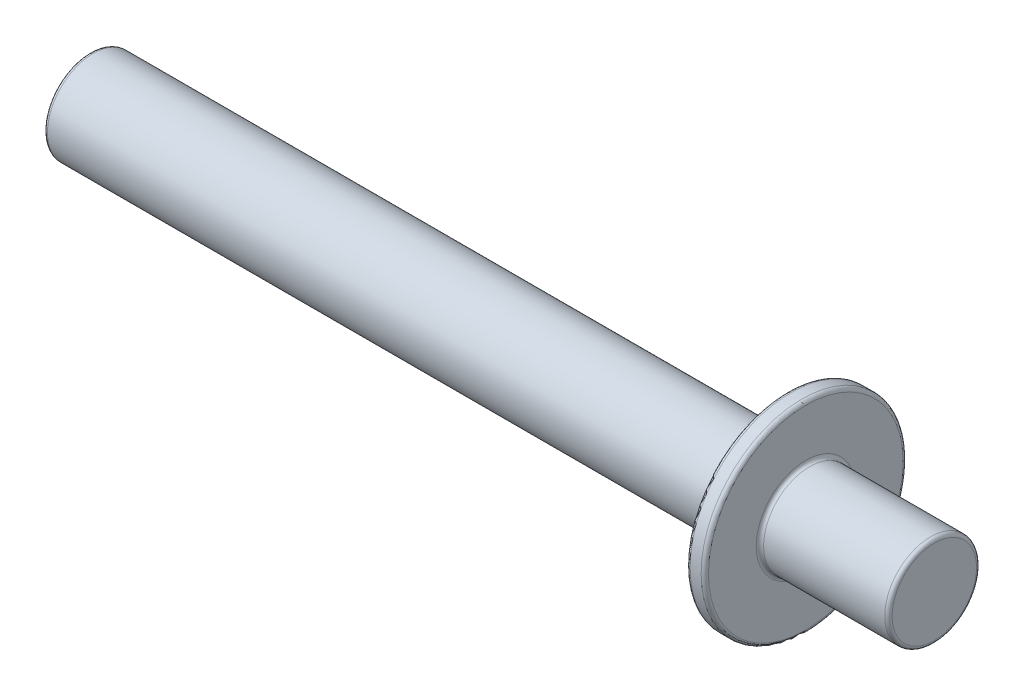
ISO-10303-21;
HEADER;
FILE_DESCRIPTION(('STEP AP214'),'2;1');
FILE_NAME('part.step','',(''),(''),'','','');
FILE_SCHEMA(('AUTOMOTIVE_DESIGN { 1 0 10303 214 1 1 1 1 }'));
ENDSEC;
DATA;
#1=APPLICATION_CONTEXT('core data for automotive mechanical design processes');
#2=APPLICATION_PROTOCOL_DEFINITION('international standard','automotive_design',2000,#1);
#3=PRODUCT_CONTEXT('',#1,'mechanical');
#4=PRODUCT('Part','Part','',(#3));
#5=PRODUCT_RELATED_PRODUCT_CATEGORY('part','',(#4));
#6=PRODUCT_DEFINITION_FORMATION('','',#4);
#7=PRODUCT_DEFINITION_CONTEXT('part definition',#1,'design');
#8=PRODUCT_DEFINITION('design','',#6,#7);
#9=PRODUCT_DEFINITION_SHAPE('','',#8);
#10=(LENGTH_UNIT() NAMED_UNIT(*) SI_UNIT(.MILLI.,.METRE.));
#11=(NAMED_UNIT(*) PLANE_ANGLE_UNIT() SI_UNIT($,.RADIAN.));
#12=(NAMED_UNIT(*) SI_UNIT($,.STERADIAN.) SOLID_ANGLE_UNIT());
#13=UNCERTAINTY_MEASURE_WITH_UNIT(LENGTH_MEASURE(1.E-05),#10,'distance_accuracy_value','');
#14=(GEOMETRIC_REPRESENTATION_CONTEXT(3) GLOBAL_UNCERTAINTY_ASSIGNED_CONTEXT((#13)) GLOBAL_UNIT_ASSIGNED_CONTEXT((#10,
#11,#12)) REPRESENTATION_CONTEXT('',''));
#15=CARTESIAN_POINT('',(0.,0.,0.));
#16=DIRECTION('',(0.,0.,1.));
#17=DIRECTION('',(1.,0.,0.));
#18=AXIS2_PLACEMENT_3D('',#15,#16,#17);
#19=CARTESIAN_POINT('',(-46.,0.,0.));
#20=DIRECTION('',(1.,0.,0.));
#21=DIRECTION('',(0.,0.,-1.));
#22=AXIS2_PLACEMENT_3D('',#19,#20,#21);
#23=PLANE('',#22);
#24=CARTESIAN_POINT('',(-46.,0.,0.));
#25=DIRECTION('',(1.,0.,0.));
#26=DIRECTION('',(0.,0.,-1.));
#27=AXIS2_PLACEMENT_3D('',#24,#25,#26);
#28=CIRCLE('',#27,2.3);
#29=CARTESIAN_POINT('',(-46.,0.,-2.3));
#30=VERTEX_POINT('',#29);
#31=EDGE_CURVE('E10',#30,#30,#28,.F.);
#32=ORIENTED_EDGE('',*,*,#31,.T.);
#33=EDGE_LOOP('',(#32));
#34=FACE_BOUND('',#33,.T.);
#35=ADVANCED_FACE('F29',(#34),#23,.F.);
#36=CARTESIAN_POINT('',(-86.0867088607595,0.,0.));
#37=DIRECTION('',(-1.,0.,0.));
#38=DIRECTION('',(0.,0.,1.));
#39=AXIS2_PLACEMENT_3D('',#36,#37,#38);
#40=CYLINDRICAL_SURFACE('',#39,2.5);
#41=CARTESIAN_POINT('',(-8.20000000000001,0.,0.));
#42=DIRECTION('',(1.,0.,0.));
#43=DIRECTION('',(0.,0.,-1.));
#44=AXIS2_PLACEMENT_3D('',#41,#42,#43);
#45=CIRCLE('',#44,2.5);
#46=CARTESIAN_POINT('',(-8.20000000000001,0.,-2.5));
#47=VERTEX_POINT('',#46);
#48=EDGE_CURVE('E35',#47,#47,#45,.F.);
#49=ORIENTED_EDGE('',*,*,#48,.T.);
#50=EDGE_LOOP('',(#49));
#51=FACE_BOUND('',#50,.T.);
#52=CARTESIAN_POINT('',(-45.8,0.,0.));
#53=DIRECTION('',(1.,0.,0.));
#54=DIRECTION('',(0.,0.,-1.));
#55=AXIS2_PLACEMENT_3D('',#52,#53,#54);
#56=CIRCLE('',#55,2.5);
#57=CARTESIAN_POINT('',(-45.8,0.,-2.5));
#58=VERTEX_POINT('',#57);
#59=EDGE_CURVE('E39',#58,#58,#56,.T.);
#60=ORIENTED_EDGE('',*,*,#59,.T.);
#61=EDGE_LOOP('',(#60));
#62=FACE_BOUND('',#61,.T.);
#63=ADVANCED_FACE('F86',(#51,#62),#40,.T.);
#64=CARTESIAN_POINT('',(-8.00000000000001,2.5,0.));
#65=DIRECTION('',(1.,0.,0.));
#66=DIRECTION('',(0.,0.,-1.));
#67=AXIS2_PLACEMENT_3D('',#64,#65,#66);
#68=PLANE('',#67);
#69=CARTESIAN_POINT('',(-8.00000000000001,0.,0.));
#70=DIRECTION('',(1.,0.,0.));
#71=DIRECTION('',(0.,0.,-1.));
#72=AXIS2_PLACEMENT_3D('',#69,#70,#71);
#73=CIRCLE('',#72,5.3);
#74=CARTESIAN_POINT('',(-8.00000000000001,0.,-5.3));
#75=VERTEX_POINT('',#74);
#76=EDGE_CURVE('E54',#75,#75,#73,.F.);
#77=ORIENTED_EDGE('',*,*,#76,.T.);
#78=EDGE_LOOP('',(#77));
#79=FACE_BOUND('',#78,.T.);
#80=CARTESIAN_POINT('',(-8.00000000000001,0.,0.));
#81=DIRECTION('',(1.,0.,0.));
#82=DIRECTION('',(0.,0.,-1.));
#83=AXIS2_PLACEMENT_3D('',#80,#81,#82);
#84=CIRCLE('',#83,2.7);
#85=CARTESIAN_POINT('',(-8.00000000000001,0.,-2.7));
#86=VERTEX_POINT('',#85);
#87=EDGE_CURVE('E57',#86,#86,#84,.T.);
#88=ORIENTED_EDGE('',*,*,#87,.T.);
#89=EDGE_LOOP('',(#88));
#90=FACE_BOUND('',#89,.T.);
#91=ADVANCED_FACE('F83',(#79,#90),#68,.F.);
#92=CARTESIAN_POINT('',(-86.0867088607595,0.,0.));
#93=DIRECTION('',(-1.,0.,0.));
#94=DIRECTION('',(0.,0.,1.));
#95=AXIS2_PLACEMENT_3D('',#92,#93,#94);
#96=CYLINDRICAL_SURFACE('',#95,5.5);
#97=CARTESIAN_POINT('',(-7.2,0.,0.));
#98=DIRECTION('',(-1.,0.,0.));
#99=DIRECTION('',(0.,0.,1.));
#100=AXIS2_PLACEMENT_3D('',#97,#98,#99);
#101=CIRCLE('',#100,5.5);
#102=CARTESIAN_POINT('',(-7.2,0.,5.5));
#103=VERTEX_POINT('',#102);
#104=EDGE_CURVE('E66',#103,#103,#101,.T.);
#105=ORIENTED_EDGE('',*,*,#104,.T.);
#106=EDGE_LOOP('',(#105));
#107=FACE_BOUND('',#106,.T.);
#108=CARTESIAN_POINT('',(-7.8,0.,0.));
#109=DIRECTION('',(1.,0.,0.));
#110=DIRECTION('',(0.,0.,-1.));
#111=AXIS2_PLACEMENT_3D('',#108,#109,#110);
#112=CIRCLE('',#111,5.5);
#113=CARTESIAN_POINT('',(-7.8,0.,-5.5));
#114=VERTEX_POINT('',#113);
#115=EDGE_CURVE('E69',#114,#114,#112,.T.);
#116=ORIENTED_EDGE('',*,*,#115,.T.);
#117=EDGE_LOOP('',(#116));
#118=FACE_BOUND('',#117,.T.);
#119=ADVANCED_FACE('F73',(#107,#118),#96,.T.);
#120=CARTESIAN_POINT('',(-7.,5.5,0.));
#121=DIRECTION('',(-1.,0.,0.));
#122=DIRECTION('',(0.,0.,1.));
#123=AXIS2_PLACEMENT_3D('',#120,#121,#122);
#124=PLANE('',#123);
#125=CARTESIAN_POINT('',(-7.,0.,0.));
#126=DIRECTION('',(-1.,0.,0.));
#127=DIRECTION('',(0.,0.,1.));
#128=AXIS2_PLACEMENT_3D('',#125,#126,#127);
#129=CIRCLE('',#128,5.3);
#130=CARTESIAN_POINT('',(-7.,0.,5.3));
#131=VERTEX_POINT('',#130);
#132=EDGE_CURVE('E60',#131,#131,#129,.F.);
#133=ORIENTED_EDGE('',*,*,#132,.T.);
#134=EDGE_LOOP('',(#133));
#135=FACE_BOUND('',#134,.T.);
#136=CARTESIAN_POINT('',(-7.,0.,0.));
#137=DIRECTION('',(-1.,0.,0.));
#138=DIRECTION('',(0.,0.,1.));
#139=AXIS2_PLACEMENT_3D('',#136,#137,#138);
#140=CIRCLE('',#139,2.7);
#141=CARTESIAN_POINT('',(-7.,0.,2.7));
#142=VERTEX_POINT('',#141);
#143=EDGE_CURVE('E63',#142,#142,#140,.T.);
#144=ORIENTED_EDGE('',*,*,#143,.T.);
#145=EDGE_LOOP('',(#144));
#146=FACE_BOUND('',#145,.T.);
#147=ADVANCED_FACE('F114',(#135,#146),#124,.F.);
#148=CARTESIAN_POINT('',(-86.0867088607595,0.,0.));
#149=DIRECTION('',(-1.,0.,0.));
#150=DIRECTION('',(0.,0.,1.));
#151=AXIS2_PLACEMENT_3D('',#148,#149,#150);
#152=CYLINDRICAL_SURFACE('',#151,2.5);
#153=CARTESIAN_POINT('',(-0.200000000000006,0.,0.));
#154=DIRECTION('',(-1.,0.,0.));
#155=DIRECTION('',(0.,0.,1.));
#156=AXIS2_PLACEMENT_3D('',#153,#154,#155);
#157=CIRCLE('',#156,2.5);
#158=CARTESIAN_POINT('',(-0.200000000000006,0.,2.5));
#159=VERTEX_POINT('',#158);
#160=EDGE_CURVE('E48',#159,#159,#157,.T.);
#161=ORIENTED_EDGE('',*,*,#160,.T.);
#162=EDGE_LOOP('',(#161));
#163=FACE_BOUND('',#162,.T.);
#164=CARTESIAN_POINT('',(-6.8,0.,0.));
#165=DIRECTION('',(-1.,0.,0.));
#166=DIRECTION('',(0.,0.,1.));
#167=AXIS2_PLACEMENT_3D('',#164,#165,#166);
#168=CIRCLE('',#167,2.5);
#169=CARTESIAN_POINT('',(-6.8,0.,2.5));
#170=VERTEX_POINT('',#169);
#171=EDGE_CURVE('E51',#170,#170,#168,.F.);
#172=ORIENTED_EDGE('',*,*,#171,.T.);
#173=EDGE_LOOP('',(#172));
#174=FACE_BOUND('',#173,.T.);
#175=ADVANCED_FACE('F118',(#163,#174),#152,.T.);
#176=CARTESIAN_POINT('',(0.,2.5,0.));
#177=DIRECTION('',(-1.,0.,0.));
#178=DIRECTION('',(0.,0.,1.));
#179=AXIS2_PLACEMENT_3D('',#176,#177,#178);
#180=PLANE('',#179);
#181=CARTESIAN_POINT('',(0.,0.,0.));
#182=DIRECTION('',(-1.,0.,0.));
#183=DIRECTION('',(0.,0.,1.));
#184=AXIS2_PLACEMENT_3D('',#181,#182,#183);
#185=CIRCLE('',#184,2.3);
#186=CARTESIAN_POINT('',(0.,0.,2.3));
#187=VERTEX_POINT('',#186);
#188=EDGE_CURVE('E43',#187,#187,#185,.F.);
#189=ORIENTED_EDGE('',*,*,#188,.T.);
#190=EDGE_LOOP('',(#189));
#191=FACE_BOUND('',#190,.T.);
#192=ADVANCED_FACE('F122',(#191),#180,.F.);
#193=CARTESIAN_POINT('',(-7.2,0.,0.));
#194=DIRECTION('',(-1.,0.,0.));
#195=DIRECTION('',(0.,0.,1.));
#196=AXIS2_PLACEMENT_3D('',#193,#194,#195);
#197=TOROIDAL_SURFACE('',#196,5.3,0.2);
#198=ORIENTED_EDGE('',*,*,#132,.F.);
#199=EDGE_LOOP('',(#198));
#200=FACE_BOUND('',#199,.T.);
#201=ORIENTED_EDGE('',*,*,#104,.F.);
#202=EDGE_LOOP('',(#201));
#203=FACE_BOUND('',#202,.T.);
#204=ADVANCED_FACE('F79',(#200,#203),#197,.T.);
#205=CARTESIAN_POINT('',(-7.8,0.,0.));
#206=DIRECTION('',(1.,0.,0.));
#207=DIRECTION('',(0.,0.,-1.));
#208=AXIS2_PLACEMENT_3D('',#205,#206,#207);
#209=TOROIDAL_SURFACE('',#208,5.3,0.2);
#210=ORIENTED_EDGE('',*,*,#115,.F.);
#211=EDGE_LOOP('',(#210));
#212=FACE_BOUND('',#211,.T.);
#213=ORIENTED_EDGE('',*,*,#76,.F.);
#214=EDGE_LOOP('',(#213));
#215=FACE_BOUND('',#214,.T.);
#216=ADVANCED_FACE('F75',(#212,#215),#209,.T.);
#217=CARTESIAN_POINT('',(-0.200000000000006,0.,0.));
#218=DIRECTION('',(-1.,0.,0.));
#219=DIRECTION('',(0.,0.,1.));
#220=AXIS2_PLACEMENT_3D('',#217,#218,#219);
#221=TOROIDAL_SURFACE('',#220,2.3,0.2);
#222=ORIENTED_EDGE('',*,*,#188,.F.);
#223=EDGE_LOOP('',(#222));
#224=FACE_BOUND('',#223,.T.);
#225=ORIENTED_EDGE('',*,*,#160,.F.);
#226=EDGE_LOOP('',(#225));
#227=FACE_BOUND('',#226,.T.);
#228=ADVANCED_FACE('F78',(#224,#227),#221,.T.);
#229=CARTESIAN_POINT('',(-6.8,0.,0.));
#230=DIRECTION('',(-1.,0.,0.));
#231=DIRECTION('',(0.,0.,1.));
#232=AXIS2_PLACEMENT_3D('',#229,#230,#231);
#233=TOROIDAL_SURFACE('',#232,2.7,0.2);
#234=ORIENTED_EDGE('',*,*,#171,.F.);
#235=EDGE_LOOP('',(#234));
#236=FACE_BOUND('',#235,.T.);
#237=ORIENTED_EDGE('',*,*,#143,.F.);
#238=EDGE_LOOP('',(#237));
#239=FACE_BOUND('',#238,.T.);
#240=ADVANCED_FACE('F94',(#236,#239),#233,.F.);
#241=CARTESIAN_POINT('',(-8.20000000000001,0.,0.));
#242=DIRECTION('',(1.,0.,0.));
#243=DIRECTION('',(0.,0.,-1.));
#244=AXIS2_PLACEMENT_3D('',#241,#242,#243);
#245=TOROIDAL_SURFACE('',#244,2.7,0.2);
#246=ORIENTED_EDGE('',*,*,#87,.F.);
#247=EDGE_LOOP('',(#246));
#248=FACE_BOUND('',#247,.T.);
#249=ORIENTED_EDGE('',*,*,#48,.F.);
#250=EDGE_LOOP('',(#249));
#251=FACE_BOUND('',#250,.T.);
#252=ADVANCED_FACE('F90',(#248,#251),#245,.F.);
#253=CARTESIAN_POINT('',(-45.8,0.,0.));
#254=DIRECTION('',(1.,0.,0.));
#255=DIRECTION('',(0.,0.,-1.));
#256=AXIS2_PLACEMENT_3D('',#253,#254,#255);
#257=TOROIDAL_SURFACE('',#256,2.3,0.2);
#258=ORIENTED_EDGE('',*,*,#59,.F.);
#259=EDGE_LOOP('',(#258));
#260=FACE_BOUND('',#259,.T.);
#261=ORIENTED_EDGE('',*,*,#31,.F.);
#262=EDGE_LOOP('',(#261));
#263=FACE_BOUND('',#262,.T.);
#264=ADVANCED_FACE('F93',(#260,#263),#257,.T.);
#265=CLOSED_SHELL('',(#35,#63,#91,#119,#147,#175,#192,#204,#216,#228,#240,#252,#264));
#266=MANIFOLD_SOLID_BREP('B2',#265);
#267=ADVANCED_BREP_SHAPE_REPRESENTATION('',(#18,#266),#14);
#268=SHAPE_DEFINITION_REPRESENTATION(#9,#267);
ENDSEC;
END-ISO-10303-21;
